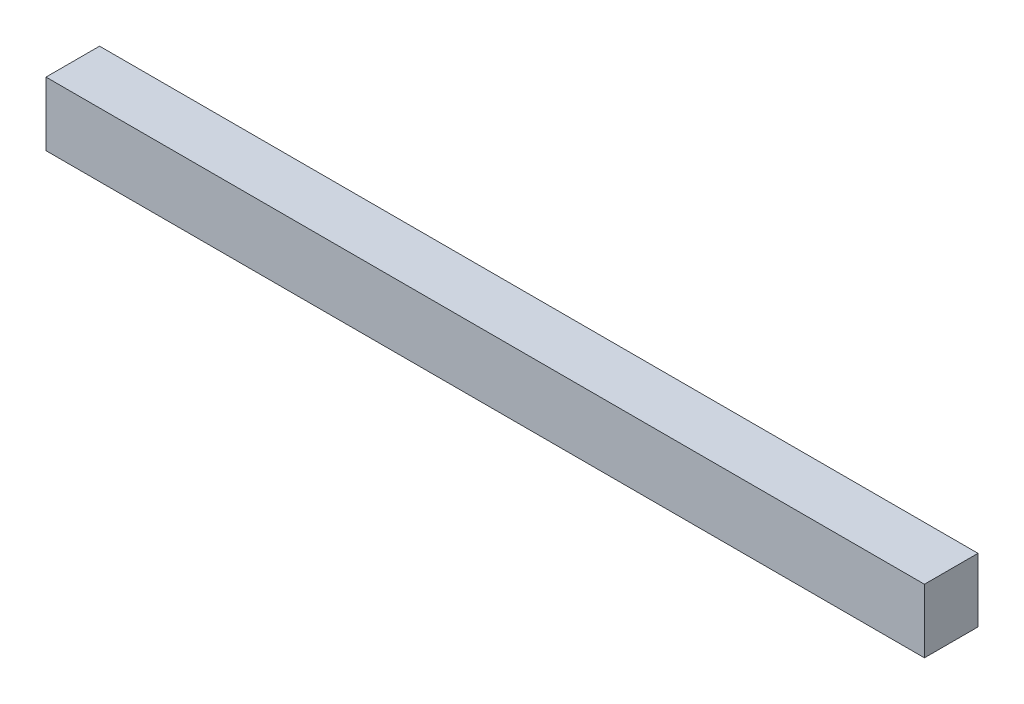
ISO-10303-21;
HEADER;
FILE_DESCRIPTION(('STEP AP214'),'2;1');
FILE_NAME('part.step','',(''),(''),'','','');
FILE_SCHEMA(('AUTOMOTIVE_DESIGN { 1 0 10303 214 1 1 1 1 }'));
ENDSEC;
DATA;
#1=APPLICATION_CONTEXT('core data for automotive mechanical design processes');
#2=APPLICATION_PROTOCOL_DEFINITION('international standard','automotive_design',2000,#1);
#3=PRODUCT_CONTEXT('',#1,'mechanical');
#4=PRODUCT('Part','Part','',(#3));
#5=PRODUCT_RELATED_PRODUCT_CATEGORY('part','',(#4));
#6=PRODUCT_DEFINITION_FORMATION('','',#4);
#7=PRODUCT_DEFINITION_CONTEXT('part definition',#1,'design');
#8=PRODUCT_DEFINITION('design','',#6,#7);
#9=PRODUCT_DEFINITION_SHAPE('','',#8);
#10=(LENGTH_UNIT() NAMED_UNIT(*) SI_UNIT(.MILLI.,.METRE.));
#11=(NAMED_UNIT(*) PLANE_ANGLE_UNIT() SI_UNIT($,.RADIAN.));
#12=(NAMED_UNIT(*) SI_UNIT($,.STERADIAN.) SOLID_ANGLE_UNIT());
#13=UNCERTAINTY_MEASURE_WITH_UNIT(LENGTH_MEASURE(1.E-05),#10,'distance_accuracy_value','');
#14=(GEOMETRIC_REPRESENTATION_CONTEXT(3) GLOBAL_UNCERTAINTY_ASSIGNED_CONTEXT((#13)) GLOBAL_UNIT_ASSIGNED_CONTEXT((#10,
#11,#12)) REPRESENTATION_CONTEXT('',''));
#15=CARTESIAN_POINT('',(0.,0.,0.));
#16=DIRECTION('',(0.,0.,1.));
#17=DIRECTION('',(1.,0.,0.));
#18=AXIS2_PLACEMENT_3D('',#15,#16,#17);
#19=CARTESIAN_POINT('',(10.4200000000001,-28.2,-28.3));
#20=DIRECTION('',(1.,0.,0.));
#21=DIRECTION('',(0.,0.,1.));
#22=AXIS2_PLACEMENT_3D('',#19,#20,#21);
#23=PLANE('',#22);
#24=CARTESIAN_POINT('',(10.4200000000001,-29.7119999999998,-28.3));
#25=CARTESIAN_POINT('',(10.4200000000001,-29.6111999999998,-28.3));
#26=CARTESIAN_POINT('',(10.4200000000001,-29.5103999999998,-28.3));
#27=CARTESIAN_POINT('',(10.4200000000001,-29.3087999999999,-28.3));
#28=CARTESIAN_POINT('',(10.4200000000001,-29.2079999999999,-28.3));
#29=CARTESIAN_POINT('',(10.4200000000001,-29.0063999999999,-28.3));
#30=CARTESIAN_POINT('',(10.4200000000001,-28.9055999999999,-28.3));
#31=CARTESIAN_POINT('',(10.4200000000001,-28.7039999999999,-28.3));
#32=CARTESIAN_POINT('',(10.4200000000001,-28.6031999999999,-28.3));
#33=CARTESIAN_POINT('',(10.4200000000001,-28.4016,-28.3));
#34=CARTESIAN_POINT('',(10.4200000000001,-28.3008,-28.3));
#35=CARTESIAN_POINT('',(10.4200000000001,-28.2,-28.3));
#36=B_SPLINE_CURVE_WITH_KNOTS('',3,(#24,#25,#26,#27,#28,#29,#30,#31,#32,#33,#34,#35),
.UNSPECIFIED.,.F.,.F.,(4,2,2,2,2,4),(0.,0.2,0.4,0.6,0.8,1.),.UNSPECIFIED.);
#37=CARTESIAN_POINT('',(10.4200000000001,-29.7119999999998,-28.3));
#38=VERTEX_POINT('',#37);
#39=CARTESIAN_POINT('',(10.4200000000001,-28.2,-28.3));
#40=VERTEX_POINT('',#39);
#41=EDGE_CURVE('E10',#38,#40,#36,.T.);
#42=ORIENTED_EDGE('',*,*,#41,.T.);
#43=CARTESIAN_POINT('',(10.4200000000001,-28.2,-27.03));
#44=CARTESIAN_POINT('',(10.4200000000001,-28.2,-27.1146666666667));
#45=CARTESIAN_POINT('',(10.4200000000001,-28.2,-27.1993333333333));
#46=CARTESIAN_POINT('',(10.4200000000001,-28.2,-27.3686666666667));
#47=CARTESIAN_POINT('',(10.4200000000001,-28.2,-27.4533333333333));
#48=CARTESIAN_POINT('',(10.4200000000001,-28.2,-27.6226666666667));
#49=CARTESIAN_POINT('',(10.4200000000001,-28.2,-27.7073333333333));
#50=CARTESIAN_POINT('',(10.4200000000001,-28.2,-27.8766666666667));
#51=CARTESIAN_POINT('',(10.4200000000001,-28.2,-27.9613333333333));
#52=CARTESIAN_POINT('',(10.4200000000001,-28.2,-28.1306666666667));
#53=CARTESIAN_POINT('',(10.4200000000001,-28.2,-28.2153333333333));
#54=CARTESIAN_POINT('',(10.4200000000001,-28.2,-28.3));
#55=B_SPLINE_CURVE_WITH_KNOTS('',3,(#43,#44,#45,#46,#47,#48,#49,#50,#51,#52,#53,#54),
.UNSPECIFIED.,.F.,.F.,(4,2,2,2,2,4),(0.,0.2,0.4,0.6,0.8,1.),.UNSPECIFIED.);
#56=CARTESIAN_POINT('',(10.4200000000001,-28.2,-27.03));
#57=VERTEX_POINT('',#56);
#58=EDGE_CURVE('E33',#57,#40,#55,.T.);
#59=ORIENTED_EDGE('',*,*,#58,.F.);
#60=CARTESIAN_POINT('',(10.4200000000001,-29.7119999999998,-27.03));
#61=CARTESIAN_POINT('',(10.4200000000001,-29.6111999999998,-27.03));
#62=CARTESIAN_POINT('',(10.4200000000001,-29.5103999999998,-27.03));
#63=CARTESIAN_POINT('',(10.4200000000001,-29.3087999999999,-27.03));
#64=CARTESIAN_POINT('',(10.4200000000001,-29.2079999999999,-27.03));
#65=CARTESIAN_POINT('',(10.4200000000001,-29.0063999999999,-27.03));
#66=CARTESIAN_POINT('',(10.4200000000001,-28.9055999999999,-27.03));
#67=CARTESIAN_POINT('',(10.4200000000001,-28.7039999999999,-27.03));
#68=CARTESIAN_POINT('',(10.4200000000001,-28.6031999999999,-27.03));
#69=CARTESIAN_POINT('',(10.4200000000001,-28.4016,-27.03));
#70=CARTESIAN_POINT('',(10.4200000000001,-28.3008,-27.03));
#71=CARTESIAN_POINT('',(10.4200000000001,-28.2,-27.03));
#72=B_SPLINE_CURVE_WITH_KNOTS('',3,(#60,#61,#62,#63,#64,#65,#66,#67,#68,#69,#70,#71),
.UNSPECIFIED.,.F.,.F.,(4,2,2,2,2,4),(0.,0.2,0.4,0.6,0.8,1.),.UNSPECIFIED.);
#73=CARTESIAN_POINT('',(10.4200000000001,-29.7119999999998,-27.03));
#74=VERTEX_POINT('',#73);
#75=EDGE_CURVE('E81',#74,#57,#72,.T.);
#76=ORIENTED_EDGE('',*,*,#75,.F.);
#77=CARTESIAN_POINT('',(10.4200000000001,-29.7119999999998,-27.03));
#78=CARTESIAN_POINT('',(10.4200000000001,-29.7119999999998,-27.1146666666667));
#79=CARTESIAN_POINT('',(10.4200000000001,-29.7119999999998,-27.1993333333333));
#80=CARTESIAN_POINT('',(10.4200000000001,-29.7119999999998,-27.3686666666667));
#81=CARTESIAN_POINT('',(10.4200000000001,-29.7119999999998,-27.4533333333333));
#82=CARTESIAN_POINT('',(10.4200000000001,-29.7119999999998,-27.6226666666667));
#83=CARTESIAN_POINT('',(10.4200000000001,-29.7119999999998,-27.7073333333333));
#84=CARTESIAN_POINT('',(10.4200000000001,-29.7119999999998,-27.8766666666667));
#85=CARTESIAN_POINT('',(10.4200000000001,-29.7119999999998,-27.9613333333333));
#86=CARTESIAN_POINT('',(10.4200000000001,-29.7119999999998,-28.1306666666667));
#87=CARTESIAN_POINT('',(10.4200000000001,-29.7119999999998,-28.2153333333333));
#88=CARTESIAN_POINT('',(10.4200000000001,-29.7119999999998,-28.3));
#89=B_SPLINE_CURVE_WITH_KNOTS('',3,(#77,#78,#79,#80,#81,#82,#83,#84,#85,#86,#87,#88),
.UNSPECIFIED.,.F.,.F.,(4,2,2,2,2,4),(0.,0.2,0.4,0.6,0.8,1.),.UNSPECIFIED.);
#90=EDGE_CURVE('E23',#74,#38,#89,.T.);
#91=ORIENTED_EDGE('',*,*,#90,.T.);
#92=EDGE_LOOP('',(#42,#59,#76,#91));
#93=FACE_BOUND('',#92,.T.);
#94=ADVANCED_FACE('F15',(#93),#23,.T.);
#95=CARTESIAN_POINT('',(-10.4079999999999,-29.7119999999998,-28.3));
#96=DIRECTION('',(0.,0.,-1.));
#97=DIRECTION('',(0.,1.,0.));
#98=AXIS2_PLACEMENT_3D('',#95,#96,#97);
#99=PLANE('',#98);
#100=ORIENTED_EDGE('',*,*,#41,.F.);
#101=CARTESIAN_POINT('',(-10.4079999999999,-29.7119999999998,-28.3));
#102=CARTESIAN_POINT('',(-9.01946666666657,-29.7119999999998,-28.3));
#103=CARTESIAN_POINT('',(-7.63093333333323,-29.7119999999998,-28.3));
#104=CARTESIAN_POINT('',(-4.85386666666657,-29.7119999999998,-28.3));
#105=CARTESIAN_POINT('',(-3.46533333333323,-29.7119999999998,-28.3));
#106=CARTESIAN_POINT('',(-0.688266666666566,-29.7119999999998,-28.3));
#107=CARTESIAN_POINT('',(0.700266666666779,-29.7119999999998,-28.3));
#108=CARTESIAN_POINT('',(3.47733333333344,-29.7119999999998,-28.3));
#109=CARTESIAN_POINT('',(4.86586666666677,-29.7119999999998,-28.3));
#110=CARTESIAN_POINT('',(7.64293333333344,-29.7119999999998,-28.3));
#111=CARTESIAN_POINT('',(9.03146666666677,-29.7119999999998,-28.3));
#112=CARTESIAN_POINT('',(10.4200000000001,-29.7119999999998,-28.3));
#113=B_SPLINE_CURVE_WITH_KNOTS('',3,(#101,#102,#103,#104,#105,#106,#107,#108,#109,#110,#111,
#112),.UNSPECIFIED.,.F.,.F.,(4,2,2,2,2,4),(0.,0.2,0.4,0.6,0.8,1.),.UNSPECIFIED.);
#114=CARTESIAN_POINT('',(-10.4079999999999,-29.7119999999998,-28.3));
#115=VERTEX_POINT('',#114);
#116=EDGE_CURVE('E69',#115,#38,#113,.T.);
#117=ORIENTED_EDGE('',*,*,#116,.F.);
#118=CARTESIAN_POINT('',(-10.4079999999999,-28.2,-28.3));
#119=CARTESIAN_POINT('',(-10.4079999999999,-28.3008,-28.3));
#120=CARTESIAN_POINT('',(-10.4079999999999,-28.4016,-28.3));
#121=CARTESIAN_POINT('',(-10.4079999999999,-28.6031999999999,-28.3));
#122=CARTESIAN_POINT('',(-10.4079999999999,-28.7039999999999,-28.3));
#123=CARTESIAN_POINT('',(-10.4079999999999,-28.9055999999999,-28.3));
#124=CARTESIAN_POINT('',(-10.4079999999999,-29.0063999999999,-28.3));
#125=CARTESIAN_POINT('',(-10.4079999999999,-29.2079999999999,-28.3));
#126=CARTESIAN_POINT('',(-10.4079999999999,-29.3087999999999,-28.3));
#127=CARTESIAN_POINT('',(-10.4079999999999,-29.5103999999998,-28.3));
#128=CARTESIAN_POINT('',(-10.4079999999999,-29.6111999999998,-28.3));
#129=CARTESIAN_POINT('',(-10.4079999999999,-29.7119999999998,-28.3));
#130=B_SPLINE_CURVE_WITH_KNOTS('',3,(#118,#119,#120,#121,#122,#123,#124,#125,#126,#127,#128,
#129),.UNSPECIFIED.,.F.,.F.,(4,2,2,2,2,4),(0.,0.2,0.4,0.6,0.8,1.),.UNSPECIFIED.);
#131=CARTESIAN_POINT('',(-10.4079999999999,-28.2,-28.3));
#132=VERTEX_POINT('',#131);
#133=EDGE_CURVE('E86',#132,#115,#130,.T.);
#134=ORIENTED_EDGE('',*,*,#133,.F.);
#135=CARTESIAN_POINT('',(10.4200000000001,-28.2,-28.3));
#136=CARTESIAN_POINT('',(9.03146666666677,-28.2,-28.3));
#137=CARTESIAN_POINT('',(7.64293333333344,-28.2,-28.3));
#138=CARTESIAN_POINT('',(4.86586666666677,-28.2,-28.3));
#139=CARTESIAN_POINT('',(3.47733333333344,-28.2,-28.3));
#140=CARTESIAN_POINT('',(0.70026666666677,-28.2,-28.3));
#141=CARTESIAN_POINT('',(-0.688266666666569,-28.2,-28.3));
#142=CARTESIAN_POINT('',(-3.46533333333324,-28.2,-28.3));
#143=CARTESIAN_POINT('',(-4.85386666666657,-28.2,-28.3));
#144=CARTESIAN_POINT('',(-7.63093333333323,-28.2,-28.3));
#145=CARTESIAN_POINT('',(-9.01946666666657,-28.2,-28.3));
#146=CARTESIAN_POINT('',(-10.4079999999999,-28.2,-28.3));
#147=B_SPLINE_CURVE_WITH_KNOTS('',3,(#135,#136,#137,#138,#139,#140,#141,#142,#143,#144,#145,
#146),.UNSPECIFIED.,.F.,.F.,(4,2,2,2,2,4),(0.,0.2,0.4,0.6,0.8,1.),.UNSPECIFIED.);
#148=EDGE_CURVE('E127',#40,#132,#147,.T.);
#149=ORIENTED_EDGE('',*,*,#148,.F.);
#150=EDGE_LOOP('',(#100,#117,#134,#149));
#151=FACE_BOUND('',#150,.T.);
#152=ADVANCED_FACE('F144',(#151),#99,.T.);
#153=CARTESIAN_POINT('',(-10.4079999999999,-28.2,-28.3));
#154=DIRECTION('',(0.,1.,0.));
#155=DIRECTION('',(0.,0.,1.));
#156=AXIS2_PLACEMENT_3D('',#153,#154,#155);
#157=PLANE('',#156);
#158=ORIENTED_EDGE('',*,*,#148,.T.);
#159=CARTESIAN_POINT('',(-10.4079999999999,-28.2,-27.03));
#160=CARTESIAN_POINT('',(-10.4079999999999,-28.2,-27.1146666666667));
#161=CARTESIAN_POINT('',(-10.4079999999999,-28.2,-27.1993333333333));
#162=CARTESIAN_POINT('',(-10.4079999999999,-28.2,-27.3686666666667));
#163=CARTESIAN_POINT('',(-10.4079999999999,-28.2,-27.4533333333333));
#164=CARTESIAN_POINT('',(-10.4079999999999,-28.2,-27.6226666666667));
#165=CARTESIAN_POINT('',(-10.4079999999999,-28.2,-27.7073333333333));
#166=CARTESIAN_POINT('',(-10.4079999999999,-28.2,-27.8766666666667));
#167=CARTESIAN_POINT('',(-10.4079999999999,-28.2,-27.9613333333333));
#168=CARTESIAN_POINT('',(-10.4079999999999,-28.2,-28.1306666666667));
#169=CARTESIAN_POINT('',(-10.4079999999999,-28.2,-28.2153333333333));
#170=CARTESIAN_POINT('',(-10.4079999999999,-28.2,-28.3));
#171=B_SPLINE_CURVE_WITH_KNOTS('',3,(#159,#160,#161,#162,#163,#164,#165,#166,#167,#168,#169,
#170),.UNSPECIFIED.,.F.,.F.,(4,2,2,2,2,4),(0.,0.2,0.4,0.6,0.8,1.),.UNSPECIFIED.);
#172=CARTESIAN_POINT('',(-10.4079999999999,-28.2,-27.03));
#173=VERTEX_POINT('',#172);
#174=EDGE_CURVE('E121',#173,#132,#171,.T.);
#175=ORIENTED_EDGE('',*,*,#174,.F.);
#176=CARTESIAN_POINT('',(10.4200000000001,-28.2,-27.03));
#177=CARTESIAN_POINT('',(9.03146666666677,-28.2,-27.03));
#178=CARTESIAN_POINT('',(7.64293333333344,-28.2,-27.03));
#179=CARTESIAN_POINT('',(4.86586666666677,-28.2,-27.03));
#180=CARTESIAN_POINT('',(3.47733333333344,-28.2,-27.03));
#181=CARTESIAN_POINT('',(0.70026666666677,-28.2,-27.03));
#182=CARTESIAN_POINT('',(-0.688266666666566,-28.2,-27.03));
#183=CARTESIAN_POINT('',(-3.46533333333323,-28.2,-27.03));
#184=CARTESIAN_POINT('',(-4.85386666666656,-28.2,-27.03));
#185=CARTESIAN_POINT('',(-7.63093333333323,-28.2,-27.03));
#186=CARTESIAN_POINT('',(-9.01946666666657,-28.2,-27.03));
#187=CARTESIAN_POINT('',(-10.4079999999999,-28.2,-27.03));
#188=B_SPLINE_CURVE_WITH_KNOTS('',3,(#176,#177,#178,#179,#180,#181,#182,#183,#184,#185,#186,
#187),.UNSPECIFIED.,.F.,.F.,(4,2,2,2,2,4),(0.,0.2,0.4,0.6,0.8,1.),.UNSPECIFIED.);
#189=EDGE_CURVE('E63',#57,#173,#188,.T.);
#190=ORIENTED_EDGE('',*,*,#189,.F.);
#191=ORIENTED_EDGE('',*,*,#58,.T.);
#192=EDGE_LOOP('',(#158,#175,#190,#191));
#193=FACE_BOUND('',#192,.T.);
#194=ADVANCED_FACE('F125',(#193),#157,.T.);
#195=CARTESIAN_POINT('',(-10.4079999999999,-29.7119999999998,-27.03));
#196=DIRECTION('',(0.,0.,1.));
#197=DIRECTION('',(1.,0.,0.));
#198=AXIS2_PLACEMENT_3D('',#195,#196,#197);
#199=PLANE('',#198);
#200=CARTESIAN_POINT('',(-10.4079999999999,-29.7119999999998,-27.03));
#201=CARTESIAN_POINT('',(-9.01946666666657,-29.7119999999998,-27.03));
#202=CARTESIAN_POINT('',(-7.63093333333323,-29.7119999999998,-27.03));
#203=CARTESIAN_POINT('',(-4.85386666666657,-29.7119999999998,-27.03));
#204=CARTESIAN_POINT('',(-3.46533333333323,-29.7119999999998,-27.03));
#205=CARTESIAN_POINT('',(-0.688266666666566,-29.7119999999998,-27.03));
#206=CARTESIAN_POINT('',(0.70026666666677,-29.7119999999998,-27.03));
#207=CARTESIAN_POINT('',(3.47733333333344,-29.7119999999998,-27.03));
#208=CARTESIAN_POINT('',(4.86586666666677,-29.7119999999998,-27.03));
#209=CARTESIAN_POINT('',(7.64293333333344,-29.7119999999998,-27.03));
#210=CARTESIAN_POINT('',(9.03146666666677,-29.7119999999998,-27.03));
#211=CARTESIAN_POINT('',(10.4200000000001,-29.7119999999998,-27.03));
#212=B_SPLINE_CURVE_WITH_KNOTS('',3,(#200,#201,#202,#203,#204,#205,#206,#207,#208,#209,#210,
#211),.UNSPECIFIED.,.F.,.F.,(4,2,2,2,2,4),(0.,0.2,0.4,0.6,0.8,1.),.UNSPECIFIED.);
#213=CARTESIAN_POINT('',(-10.4079999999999,-29.7119999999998,-27.03));
#214=VERTEX_POINT('',#213);
#215=EDGE_CURVE('E60',#214,#74,#212,.T.);
#216=ORIENTED_EDGE('',*,*,#215,.T.);
#217=ORIENTED_EDGE('',*,*,#75,.T.);
#218=ORIENTED_EDGE('',*,*,#189,.T.);
#219=CARTESIAN_POINT('',(-10.4079999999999,-28.2,-27.03));
#220=CARTESIAN_POINT('',(-10.4079999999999,-28.3008,-27.03));
#221=CARTESIAN_POINT('',(-10.4079999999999,-28.4016,-27.03));
#222=CARTESIAN_POINT('',(-10.4079999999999,-28.6031999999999,-27.03));
#223=CARTESIAN_POINT('',(-10.4079999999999,-28.7039999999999,-27.03));
#224=CARTESIAN_POINT('',(-10.4079999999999,-28.9055999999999,-27.03));
#225=CARTESIAN_POINT('',(-10.4079999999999,-29.0063999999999,-27.03));
#226=CARTESIAN_POINT('',(-10.4079999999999,-29.2079999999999,-27.03));
#227=CARTESIAN_POINT('',(-10.4079999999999,-29.3087999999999,-27.03));
#228=CARTESIAN_POINT('',(-10.4079999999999,-29.5103999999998,-27.03));
#229=CARTESIAN_POINT('',(-10.4079999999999,-29.6111999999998,-27.03));
#230=CARTESIAN_POINT('',(-10.4079999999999,-29.7119999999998,-27.03));
#231=B_SPLINE_CURVE_WITH_KNOTS('',3,(#219,#220,#221,#222,#223,#224,#225,#226,#227,#228,#229,
#230),.UNSPECIFIED.,.F.,.F.,(4,2,2,2,2,4),(0.,0.2,0.4,0.6,0.8,1.),.UNSPECIFIED.);
#232=EDGE_CURVE('E55',#173,#214,#231,.T.);
#233=ORIENTED_EDGE('',*,*,#232,.T.);
#234=EDGE_LOOP('',(#216,#217,#218,#233));
#235=FACE_BOUND('',#234,.T.);
#236=ADVANCED_FACE('F58',(#235),#199,.T.);
#237=CARTESIAN_POINT('',(-10.4079999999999,-29.7119999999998,-27.03));
#238=DIRECTION('',(0.,-1.,0.));
#239=DIRECTION('',(0.,0.,-1.));
#240=AXIS2_PLACEMENT_3D('',#237,#238,#239);
#241=PLANE('',#240);
#242=ORIENTED_EDGE('',*,*,#116,.T.);
#243=ORIENTED_EDGE('',*,*,#90,.F.);
#244=ORIENTED_EDGE('',*,*,#215,.F.);
#245=CARTESIAN_POINT('',(-10.4079999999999,-29.7119999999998,-27.03));
#246=CARTESIAN_POINT('',(-10.4079999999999,-29.7119999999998,-27.1146666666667));
#247=CARTESIAN_POINT('',(-10.4079999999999,-29.7119999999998,-27.1993333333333));
#248=CARTESIAN_POINT('',(-10.4079999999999,-29.7119999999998,-27.3686666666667));
#249=CARTESIAN_POINT('',(-10.4079999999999,-29.7119999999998,-27.4533333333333));
#250=CARTESIAN_POINT('',(-10.4079999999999,-29.7119999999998,-27.6226666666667));
#251=CARTESIAN_POINT('',(-10.4079999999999,-29.7119999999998,-27.7073333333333));
#252=CARTESIAN_POINT('',(-10.4079999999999,-29.7119999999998,-27.8766666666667));
#253=CARTESIAN_POINT('',(-10.4079999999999,-29.7119999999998,-27.9613333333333));
#254=CARTESIAN_POINT('',(-10.4079999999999,-29.7119999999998,-28.1306666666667));
#255=CARTESIAN_POINT('',(-10.4079999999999,-29.7119999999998,-28.2153333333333));
#256=CARTESIAN_POINT('',(-10.4079999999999,-29.7119999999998,-28.3));
#257=B_SPLINE_CURVE_WITH_KNOTS('',3,(#245,#246,#247,#248,#249,#250,#251,#252,#253,#254,#255,
#256),.UNSPECIFIED.,.F.,.F.,(4,2,2,2,2,4),(0.,0.2,0.4,0.6,0.8,1.),.UNSPECIFIED.);
#258=EDGE_CURVE('E77',#214,#115,#257,.T.);
#259=ORIENTED_EDGE('',*,*,#258,.T.);
#260=EDGE_LOOP('',(#242,#243,#244,#259));
#261=FACE_BOUND('',#260,.T.);
#262=ADVANCED_FACE('F76',(#261),#241,.T.);
#263=CARTESIAN_POINT('',(-10.4079999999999,-28.2,-27.03));
#264=DIRECTION('',(-1.,0.,0.));
#265=DIRECTION('',(0.,0.,-1.));
#266=AXIS2_PLACEMENT_3D('',#263,#264,#265);
#267=PLANE('',#266);
#268=ORIENTED_EDGE('',*,*,#133,.T.);
#269=ORIENTED_EDGE('',*,*,#258,.F.);
#270=ORIENTED_EDGE('',*,*,#232,.F.);
#271=ORIENTED_EDGE('',*,*,#174,.T.);
#272=EDGE_LOOP('',(#268,#269,#270,#271));
#273=FACE_BOUND('',#272,.T.);
#274=ADVANCED_FACE('F85',(#273),#267,.T.);
#275=CLOSED_SHELL('',(#94,#152,#194,#236,#262,#274));
#276=MANIFOLD_SOLID_BREP('B1',#275);
#277=ADVANCED_BREP_SHAPE_REPRESENTATION('',(#18,#276),#14);
#278=SHAPE_DEFINITION_REPRESENTATION(#9,#277);
ENDSEC;
END-ISO-10303-21;
